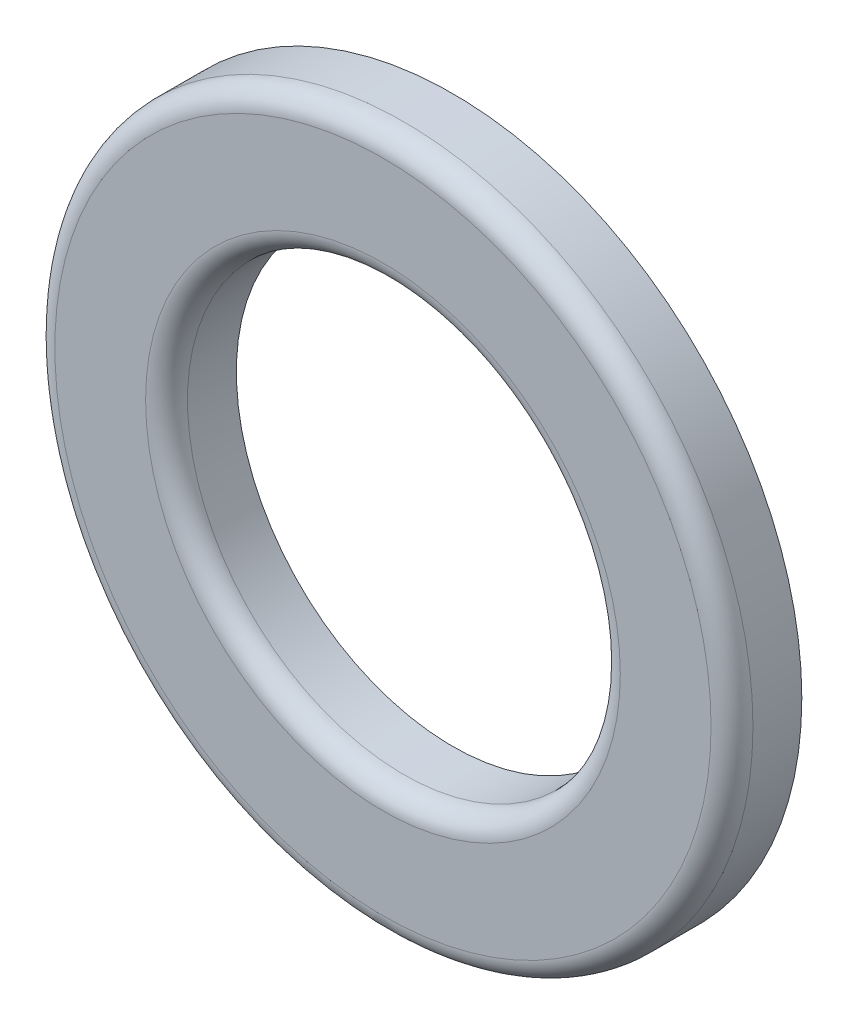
from build123d import *

# Parameters (mm, degrees)
ESQUISSE1_R          = 5
ESQUISSE1_R_2        = 3.1
BASE_EXTRUSION_DEPTH = 1
CONG_1_R             = 0.3


with BuildPart() as part:
    # Esquisse1 → Base-Extrusion (new body)
    with BuildSketch(Plane.XY):
        Circle(ESQUISSE1_R)
        Circle(ESQUISSE1_R_2, mode=Mode.SUBTRACT)
    extrude(amount=BASE_EXTRUSION_DEPTH)

    # Cong_1
    cong_1_edges = [part.edges().sort_by_distance(p)[0] for p in [
        (-5, 0, 1),
        (-3.1, 0, 1),
    ]]
    fillet(cong_1_edges, radius=CONG_1_R)


solid = part.part
